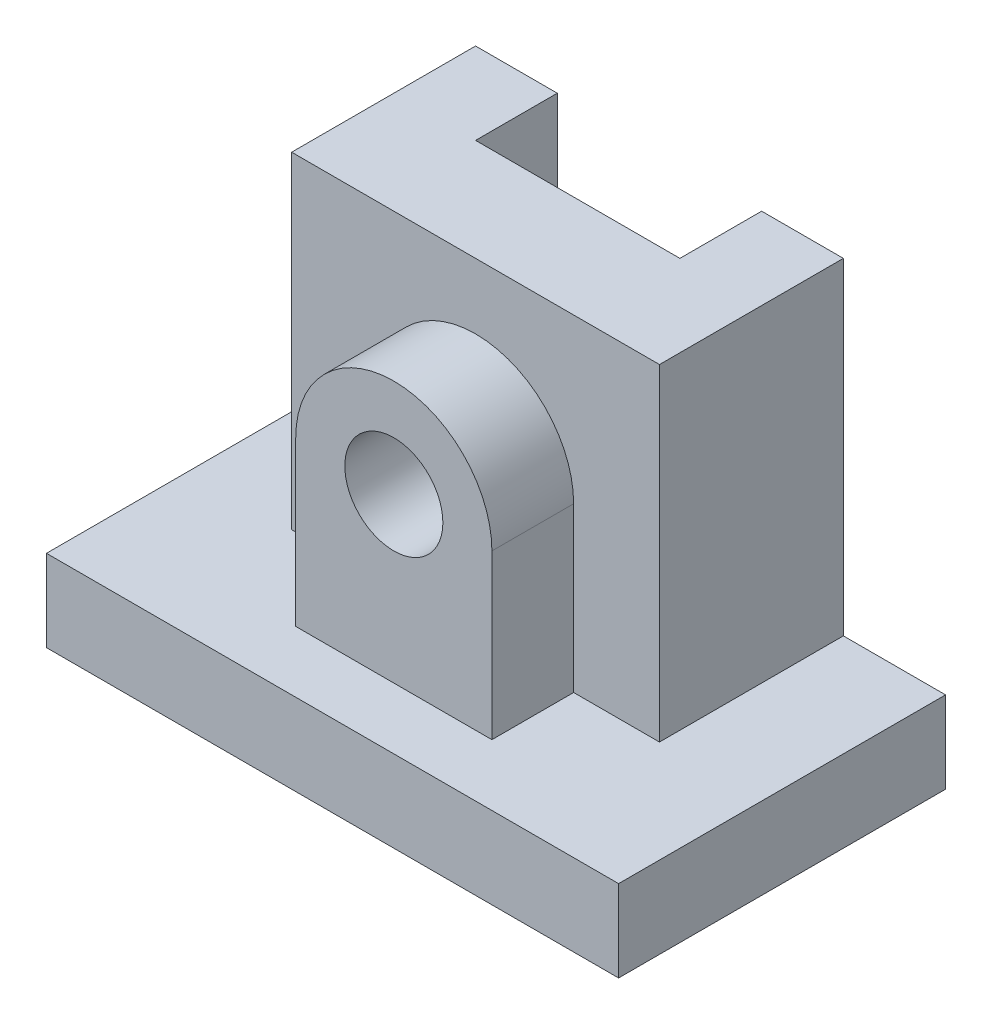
ISO-10303-21;
HEADER;
FILE_DESCRIPTION(('STEP AP214'),'2;1');
FILE_NAME('part.step','',(''),(''),'','','');
FILE_SCHEMA(('AUTOMOTIVE_DESIGN { 1 0 10303 214 1 1 1 1 }'));
ENDSEC;
DATA;
#1=APPLICATION_CONTEXT('core data for automotive mechanical design processes');
#2=APPLICATION_PROTOCOL_DEFINITION('international standard','automotive_design',2000,#1);
#3=PRODUCT_CONTEXT('',#1,'mechanical');
#4=PRODUCT('Part','Part','',(#3));
#5=PRODUCT_RELATED_PRODUCT_CATEGORY('part','',(#4));
#6=PRODUCT_DEFINITION_FORMATION('','',#4);
#7=PRODUCT_DEFINITION_CONTEXT('part definition',#1,'design');
#8=PRODUCT_DEFINITION('design','',#6,#7);
#9=PRODUCT_DEFINITION_SHAPE('','',#8);
#10=(LENGTH_UNIT() NAMED_UNIT(*) SI_UNIT(.MILLI.,.METRE.));
#11=(NAMED_UNIT(*) PLANE_ANGLE_UNIT() SI_UNIT($,.RADIAN.));
#12=(NAMED_UNIT(*) SI_UNIT($,.STERADIAN.) SOLID_ANGLE_UNIT());
#13=UNCERTAINTY_MEASURE_WITH_UNIT(LENGTH_MEASURE(1.E-05),#10,'distance_accuracy_value','');
#14=(GEOMETRIC_REPRESENTATION_CONTEXT(3) GLOBAL_UNCERTAINTY_ASSIGNED_CONTEXT((#13)) GLOBAL_UNIT_ASSIGNED_CONTEXT((#10,
#11,#12)) REPRESENTATION_CONTEXT('',''));
#15=CARTESIAN_POINT('',(0.,0.,0.));
#16=DIRECTION('',(0.,0.,1.));
#17=DIRECTION('',(1.,0.,0.));
#18=AXIS2_PLACEMENT_3D('',#15,#16,#17);
#19=CARTESIAN_POINT('',(-70.,20.,0.));
#20=DIRECTION('',(0.,0.,1.));
#21=DIRECTION('',(1.,0.,0.));
#22=AXIS2_PLACEMENT_3D('',#19,#20,#21);
#23=PLANE('',#22);
#24=DIRECTION('',(-1.,0.,0.));
#25=VECTOR('',#24,1.);
#26=CARTESIAN_POINT('',(-45.,100.,0.));
#27=LINE('',#26,#25);
#28=CARTESIAN_POINT('',(-25.,100.,0.));
#29=VERTEX_POINT('',#28);
#30=CARTESIAN_POINT('',(-45.,100.,0.));
#31=VERTEX_POINT('',#30);
#32=EDGE_CURVE('E222',#29,#31,#27,.T.);
#33=ORIENTED_EDGE('',*,*,#32,.F.);
#34=DIRECTION('',(0.,1.,0.));
#35=VECTOR('',#34,1.);
#36=CARTESIAN_POINT('',(-25.,0.,0.));
#37=LINE('',#36,#35);
#38=CARTESIAN_POINT('',(-25.,0.,0.));
#39=VERTEX_POINT('',#38);
#40=EDGE_CURVE('E176',#39,#29,#37,.T.);
#41=ORIENTED_EDGE('',*,*,#40,.F.);
#42=DIRECTION('',(-1.,0.,0.));
#43=VECTOR('',#42,1.);
#44=CARTESIAN_POINT('',(-70.,0.,0.));
#45=LINE('',#44,#43);
#46=CARTESIAN_POINT('',(-70.,0.,0.));
#47=VERTEX_POINT('',#46);
#48=EDGE_CURVE('E167',#39,#47,#45,.T.);
#49=ORIENTED_EDGE('',*,*,#48,.T.);
#50=DIRECTION('',(0.,-1.,0.));
#51=VECTOR('',#50,1.);
#52=CARTESIAN_POINT('',(-70.,20.,0.));
#53=LINE('',#52,#51);
#54=CARTESIAN_POINT('',(-70.,20.,0.));
#55=VERTEX_POINT('',#54);
#56=EDGE_CURVE('E279',#55,#47,#53,.T.);
#57=ORIENTED_EDGE('',*,*,#56,.F.);
#58=DIRECTION('',(-1.,0.,0.));
#59=VECTOR('',#58,1.);
#60=CARTESIAN_POINT('',(-70.,20.,0.));
#61=LINE('',#60,#59);
#62=CARTESIAN_POINT('',(-45.,20.,0.));
#63=VERTEX_POINT('',#62);
#64=EDGE_CURVE('E258',#63,#55,#61,.T.);
#65=ORIENTED_EDGE('',*,*,#64,.F.);
#66=DIRECTION('',(0.,-1.,0.));
#67=VECTOR('',#66,1.);
#68=CARTESIAN_POINT('',(-45.,100.,0.));
#69=LINE('',#68,#67);
#70=EDGE_CURVE('E226',#31,#63,#69,.T.);
#71=ORIENTED_EDGE('',*,*,#70,.F.);
#72=EDGE_LOOP('',(#33,#41,#49,#57,#65,#71));
#73=FACE_BOUND('',#72,.T.);
#74=ADVANCED_FACE('F31',(#73),#23,.F.);
#75=CARTESIAN_POINT('',(-70.,20.,0.));
#76=DIRECTION('',(0.,1.,0.));
#77=DIRECTION('',(0.,0.,1.));
#78=AXIS2_PLACEMENT_3D('',#75,#76,#77);
#79=PLANE('',#78);
#80=DIRECTION('',(1.,0.,0.));
#81=VECTOR('',#80,1.);
#82=CARTESIAN_POINT('',(-45.,20.,45.));
#83=LINE('',#82,#81);
#84=CARTESIAN_POINT('',(24.,20.,45.));
#85=VERTEX_POINT('',#84);
#86=CARTESIAN_POINT('',(45.,20.,45.));
#87=VERTEX_POINT('',#86);
#88=EDGE_CURVE('E229',#85,#87,#83,.T.);
#89=ORIENTED_EDGE('',*,*,#88,.F.);
#90=DIRECTION('',(0.,0.,-1.));
#91=VECTOR('',#90,1.);
#92=CARTESIAN_POINT('',(24.,20.,65.));
#93=LINE('',#92,#91);
#94=CARTESIAN_POINT('',(24.,20.,65.));
#95=VERTEX_POINT('',#94);
#96=EDGE_CURVE('E195',#95,#85,#93,.T.);
#97=ORIENTED_EDGE('',*,*,#96,.F.);
#98=DIRECTION('',(1.,0.,0.));
#99=VECTOR('',#98,1.);
#100=CARTESIAN_POINT('',(24.,20.,65.));
#101=LINE('',#100,#99);
#102=CARTESIAN_POINT('',(-24.,20.,65.));
#103=VERTEX_POINT('',#102);
#104=EDGE_CURVE('E56',#103,#95,#101,.T.);
#105=ORIENTED_EDGE('',*,*,#104,.F.);
#106=DIRECTION('',(0.,0.,-1.));
#107=VECTOR('',#106,1.);
#108=CARTESIAN_POINT('',(-24.,20.,65.));
#109=LINE('',#108,#107);
#110=CARTESIAN_POINT('',(-24.,20.,45.));
#111=VERTEX_POINT('',#110);
#112=EDGE_CURVE('E205',#103,#111,#109,.T.);
#113=ORIENTED_EDGE('',*,*,#112,.T.);
#114=CARTESIAN_POINT('',(-45.,20.,45.));
#115=VERTEX_POINT('',#114);
#116=EDGE_CURVE('E227',#115,#111,#83,.T.);
#117=ORIENTED_EDGE('',*,*,#116,.F.);
#118=DIRECTION('',(0.,0.,1.));
#119=VECTOR('',#118,1.);
#120=CARTESIAN_POINT('',(-45.,20.,0.));
#121=LINE('',#120,#119);
#122=EDGE_CURVE('E213',#63,#115,#121,.T.);
#123=ORIENTED_EDGE('',*,*,#122,.F.);
#124=ORIENTED_EDGE('',*,*,#64,.T.);
#125=DIRECTION('',(0.,0.,1.));
#126=VECTOR('',#125,1.);
#127=CARTESIAN_POINT('',(-70.,20.,0.));
#128=LINE('',#127,#126);
#129=CARTESIAN_POINT('',(-70.,20.,80.));
#130=VERTEX_POINT('',#129);
#131=EDGE_CURVE('E278',#55,#130,#128,.T.);
#132=ORIENTED_EDGE('',*,*,#131,.T.);
#133=DIRECTION('',(1.,0.,0.));
#134=VECTOR('',#133,1.);
#135=CARTESIAN_POINT('',(-70.,20.,80.));
#136=LINE('',#135,#134);
#137=CARTESIAN_POINT('',(70.,20.,80.));
#138=VERTEX_POINT('',#137);
#139=EDGE_CURVE('E351',#130,#138,#136,.T.);
#140=ORIENTED_EDGE('',*,*,#139,.T.);
#141=DIRECTION('',(0.,0.,-1.));
#142=VECTOR('',#141,1.);
#143=CARTESIAN_POINT('',(70.,20.,0.));
#144=LINE('',#143,#142);
#145=CARTESIAN_POINT('',(70.,20.,0.));
#146=VERTEX_POINT('',#145);
#147=EDGE_CURVE('E262',#138,#146,#144,.T.);
#148=ORIENTED_EDGE('',*,*,#147,.T.);
#149=CARTESIAN_POINT('',(45.,20.,0.));
#150=VERTEX_POINT('',#149);
#151=EDGE_CURVE('E261',#146,#150,#61,.T.);
#152=ORIENTED_EDGE('',*,*,#151,.T.);
#153=DIRECTION('',(0.,0.,-1.));
#154=VECTOR('',#153,1.);
#155=CARTESIAN_POINT('',(45.,20.,0.));
#156=LINE('',#155,#154);
#157=EDGE_CURVE('E218',#87,#150,#156,.T.);
#158=ORIENTED_EDGE('',*,*,#157,.F.);
#159=EDGE_LOOP('',(#89,#97,#105,#113,#117,#123,#124,#132,#140,#148,#152,#158));
#160=FACE_BOUND('',#159,.T.);
#161=ADVANCED_FACE('F297',(#160),#79,.T.);
#162=CARTESIAN_POINT('',(-45.,100.,45.));
#163=DIRECTION('',(0.,0.,-1.));
#164=DIRECTION('',(-1.,0.,0.));
#165=AXIS2_PLACEMENT_3D('',#162,#163,#164);
#166=PLANE('',#165);
#167=DIRECTION('',(0.,1.,0.));
#168=VECTOR('',#167,1.);
#169=CARTESIAN_POINT('',(24.,60.,45.));
#170=LINE('',#169,#168);
#171=CARTESIAN_POINT('',(24.,60.,45.));
#172=VERTEX_POINT('',#171);
#173=EDGE_CURVE('E185',#85,#172,#170,.T.);
#174=ORIENTED_EDGE('',*,*,#173,.F.);
#175=ORIENTED_EDGE('',*,*,#88,.T.);
#176=DIRECTION('',(0.,-1.,0.));
#177=VECTOR('',#176,1.);
#178=CARTESIAN_POINT('',(45.,100.,45.));
#179=LINE('',#178,#177);
#180=CARTESIAN_POINT('',(45.,100.,45.));
#181=VERTEX_POINT('',#180);
#182=EDGE_CURVE('E232',#181,#87,#179,.T.);
#183=ORIENTED_EDGE('',*,*,#182,.F.);
#184=DIRECTION('',(1.,0.,0.));
#185=VECTOR('',#184,1.);
#186=CARTESIAN_POINT('',(-45.,100.,45.));
#187=LINE('',#186,#185);
#188=CARTESIAN_POINT('',(-45.,100.,45.));
#189=VERTEX_POINT('',#188);
#190=EDGE_CURVE('E217',#189,#181,#187,.T.);
#191=ORIENTED_EDGE('',*,*,#190,.F.);
#192=DIRECTION('',(0.,-1.,0.));
#193=VECTOR('',#192,1.);
#194=CARTESIAN_POINT('',(-45.,100.,45.));
#195=LINE('',#194,#193);
#196=EDGE_CURVE('E248',#189,#115,#195,.T.);
#197=ORIENTED_EDGE('',*,*,#196,.T.);
#198=ORIENTED_EDGE('',*,*,#116,.T.);
#199=DIRECTION('',(0.,-1.,0.));
#200=VECTOR('',#199,1.);
#201=CARTESIAN_POINT('',(-24.,20.,45.));
#202=LINE('',#201,#200);
#203=CARTESIAN_POINT('',(-24.,60.,45.));
#204=VERTEX_POINT('',#203);
#205=EDGE_CURVE('E190',#204,#111,#202,.T.);
#206=ORIENTED_EDGE('',*,*,#205,.F.);
#207=CARTESIAN_POINT('',(0.,60.,45.));
#208=DIRECTION('',(0.,0.,1.));
#209=DIRECTION('',(-1.,0.,0.));
#210=AXIS2_PLACEMENT_3D('',#207,#208,#209);
#211=CIRCLE('',#210,24.);
#212=EDGE_CURVE('E198',#172,#204,#211,.T.);
#213=ORIENTED_EDGE('',*,*,#212,.F.);
#214=EDGE_LOOP('',(#174,#175,#183,#191,#197,#198,#206,#213));
#215=FACE_BOUND('',#214,.T.);
#216=ADVANCED_FACE('F303',(#215),#166,.F.);
#217=CARTESIAN_POINT('',(-70.,20.,0.));
#218=DIRECTION('',(1.,0.,0.));
#219=DIRECTION('',(0.,0.,-1.));
#220=AXIS2_PLACEMENT_3D('',#217,#218,#219);
#221=PLANE('',#220);
#222=DIRECTION('',(0.,0.,1.));
#223=VECTOR('',#222,1.);
#224=CARTESIAN_POINT('',(-70.,0.,0.));
#225=LINE('',#224,#223);
#226=CARTESIAN_POINT('',(-70.,0.,80.));
#227=VERTEX_POINT('',#226);
#228=EDGE_CURVE('E267',#47,#227,#225,.T.);
#229=ORIENTED_EDGE('',*,*,#228,.T.);
#230=DIRECTION('',(0.,-1.,0.));
#231=VECTOR('',#230,1.);
#232=CARTESIAN_POINT('',(-70.,20.,80.));
#233=LINE('',#232,#231);
#234=EDGE_CURVE('E11',#130,#227,#233,.T.);
#235=ORIENTED_EDGE('',*,*,#234,.F.);
#236=ORIENTED_EDGE('',*,*,#131,.F.);
#237=ORIENTED_EDGE('',*,*,#56,.T.);
#238=EDGE_LOOP('',(#229,#235,#236,#237));
#239=FACE_BOUND('',#238,.T.);
#240=ADVANCED_FACE('F33',(#239),#221,.F.);
#241=CARTESIAN_POINT('',(-70.,20.,80.));
#242=DIRECTION('',(0.,0.,-1.));
#243=DIRECTION('',(-1.,0.,0.));
#244=AXIS2_PLACEMENT_3D('',#241,#242,#243);
#245=PLANE('',#244);
#246=DIRECTION('',(1.,0.,0.));
#247=VECTOR('',#246,1.);
#248=CARTESIAN_POINT('',(-70.,0.,80.));
#249=LINE('',#248,#247);
#250=CARTESIAN_POINT('',(70.,0.,80.));
#251=VERTEX_POINT('',#250);
#252=EDGE_CURVE('E271',#227,#251,#249,.T.);
#253=ORIENTED_EDGE('',*,*,#252,.T.);
#254=DIRECTION('',(0.,-1.,0.));
#255=VECTOR('',#254,1.);
#256=CARTESIAN_POINT('',(70.,20.,80.));
#257=LINE('',#256,#255);
#258=EDGE_CURVE('E40',#138,#251,#257,.T.);
#259=ORIENTED_EDGE('',*,*,#258,.F.);
#260=ORIENTED_EDGE('',*,*,#139,.F.);
#261=ORIENTED_EDGE('',*,*,#234,.T.);
#262=EDGE_LOOP('',(#253,#259,#260,#261));
#263=FACE_BOUND('',#262,.T.);
#264=ADVANCED_FACE('F342',(#263),#245,.F.);
#265=CARTESIAN_POINT('',(70.,20.,0.));
#266=DIRECTION('',(-1.,0.,0.));
#267=DIRECTION('',(0.,0.,1.));
#268=AXIS2_PLACEMENT_3D('',#265,#266,#267);
#269=PLANE('',#268);
#270=DIRECTION('',(0.,0.,-1.));
#271=VECTOR('',#270,1.);
#272=CARTESIAN_POINT('',(70.,0.,0.));
#273=LINE('',#272,#271);
#274=CARTESIAN_POINT('',(70.,0.,0.));
#275=VERTEX_POINT('',#274);
#276=EDGE_CURVE('E273',#251,#275,#273,.T.);
#277=ORIENTED_EDGE('',*,*,#276,.T.);
#278=DIRECTION('',(0.,-1.,0.));
#279=VECTOR('',#278,1.);
#280=CARTESIAN_POINT('',(70.,20.,0.));
#281=LINE('',#280,#279);
#282=EDGE_CURVE('E282',#146,#275,#281,.T.);
#283=ORIENTED_EDGE('',*,*,#282,.F.);
#284=ORIENTED_EDGE('',*,*,#147,.F.);
#285=ORIENTED_EDGE('',*,*,#258,.T.);
#286=EDGE_LOOP('',(#277,#283,#284,#285));
#287=FACE_BOUND('',#286,.T.);
#288=ADVANCED_FACE('F290',(#287),#269,.F.);
#289=CARTESIAN_POINT('',(25.,0.,0.));
#290=VERTEX_POINT('',#289);
#291=EDGE_CURVE('E275',#275,#290,#45,.T.);
#292=ORIENTED_EDGE('',*,*,#291,.T.);
#293=DIRECTION('',(0.,1.,0.));
#294=VECTOR('',#293,1.);
#295=CARTESIAN_POINT('',(25.,0.,0.));
#296=LINE('',#295,#294);
#297=CARTESIAN_POINT('',(25.,100.,0.));
#298=VERTEX_POINT('',#297);
#299=EDGE_CURVE('E178',#290,#298,#296,.T.);
#300=ORIENTED_EDGE('',*,*,#299,.T.);
#301=CARTESIAN_POINT('',(45.,100.,0.));
#302=VERTEX_POINT('',#301);
#303=EDGE_CURVE('E223',#302,#298,#27,.T.);
#304=ORIENTED_EDGE('',*,*,#303,.F.);
#305=DIRECTION('',(0.,-1.,0.));
#306=VECTOR('',#305,1.);
#307=CARTESIAN_POINT('',(45.,100.,0.));
#308=LINE('',#307,#306);
#309=EDGE_CURVE('E240',#302,#150,#308,.T.);
#310=ORIENTED_EDGE('',*,*,#309,.T.);
#311=ORIENTED_EDGE('',*,*,#151,.F.);
#312=ORIENTED_EDGE('',*,*,#282,.T.);
#313=EDGE_LOOP('',(#292,#300,#304,#310,#311,#312));
#314=FACE_BOUND('',#313,.T.);
#315=ADVANCED_FACE('F294',(#314),#23,.F.);
#316=CARTESIAN_POINT('',(-70.,0.,0.));
#317=DIRECTION('',(0.,1.,0.));
#318=DIRECTION('',(0.,0.,1.));
#319=AXIS2_PLACEMENT_3D('',#316,#317,#318);
#320=PLANE('',#319);
#321=ORIENTED_EDGE('',*,*,#48,.F.);
#322=DIRECTION('',(0.,0.,1.));
#323=VECTOR('',#322,1.);
#324=CARTESIAN_POINT('',(-25.,0.,0.));
#325=LINE('',#324,#323);
#326=CARTESIAN_POINT('',(-25.,0.,20.));
#327=VERTEX_POINT('',#326);
#328=EDGE_CURVE('E148',#39,#327,#325,.T.);
#329=ORIENTED_EDGE('',*,*,#328,.T.);
#330=DIRECTION('',(1.,0.,0.));
#331=VECTOR('',#330,1.);
#332=CARTESIAN_POINT('',(-25.,0.,20.));
#333=LINE('',#332,#331);
#334=CARTESIAN_POINT('',(25.,0.,20.));
#335=VERTEX_POINT('',#334);
#336=EDGE_CURVE('E157',#327,#335,#333,.T.);
#337=ORIENTED_EDGE('',*,*,#336,.T.);
#338=DIRECTION('',(0.,0.,-1.));
#339=VECTOR('',#338,1.);
#340=CARTESIAN_POINT('',(25.,0.,0.));
#341=LINE('',#340,#339);
#342=EDGE_CURVE('E154',#335,#290,#341,.T.);
#343=ORIENTED_EDGE('',*,*,#342,.T.);
#344=ORIENTED_EDGE('',*,*,#291,.F.);
#345=ORIENTED_EDGE('',*,*,#276,.F.);
#346=ORIENTED_EDGE('',*,*,#252,.F.);
#347=ORIENTED_EDGE('',*,*,#228,.F.);
#348=EDGE_LOOP('',(#321,#329,#337,#343,#344,#345,#346,#347));
#349=FACE_BOUND('',#348,.T.);
#350=ADVANCED_FACE('F165',(#349),#320,.F.);
#351=CARTESIAN_POINT('',(-45.,100.,0.));
#352=DIRECTION('',(1.,0.,0.));
#353=DIRECTION('',(0.,0.,-1.));
#354=AXIS2_PLACEMENT_3D('',#351,#352,#353);
#355=PLANE('',#354);
#356=ORIENTED_EDGE('',*,*,#122,.T.);
#357=ORIENTED_EDGE('',*,*,#196,.F.);
#358=DIRECTION('',(0.,0.,1.));
#359=VECTOR('',#358,1.);
#360=CARTESIAN_POINT('',(-45.,100.,0.));
#361=LINE('',#360,#359);
#362=EDGE_CURVE('E214',#31,#189,#361,.T.);
#363=ORIENTED_EDGE('',*,*,#362,.F.);
#364=ORIENTED_EDGE('',*,*,#70,.T.);
#365=EDGE_LOOP('',(#356,#357,#363,#364));
#366=FACE_BOUND('',#365,.T.);
#367=ADVANCED_FACE('F318',(#366),#355,.F.);
#368=CARTESIAN_POINT('',(45.,100.,0.));
#369=DIRECTION('',(-1.,0.,0.));
#370=DIRECTION('',(0.,0.,1.));
#371=AXIS2_PLACEMENT_3D('',#368,#369,#370);
#372=PLANE('',#371);
#373=ORIENTED_EDGE('',*,*,#157,.T.);
#374=ORIENTED_EDGE('',*,*,#309,.F.);
#375=DIRECTION('',(0.,0.,-1.));
#376=VECTOR('',#375,1.);
#377=CARTESIAN_POINT('',(45.,100.,0.));
#378=LINE('',#377,#376);
#379=EDGE_CURVE('E220',#181,#302,#378,.T.);
#380=ORIENTED_EDGE('',*,*,#379,.F.);
#381=ORIENTED_EDGE('',*,*,#182,.T.);
#382=EDGE_LOOP('',(#373,#374,#380,#381));
#383=FACE_BOUND('',#382,.T.);
#384=ADVANCED_FACE('F299',(#383),#372,.F.);
#385=CARTESIAN_POINT('',(-45.,100.,45.));
#386=DIRECTION('',(0.,1.,0.));
#387=DIRECTION('',(0.,0.,1.));
#388=AXIS2_PLACEMENT_3D('',#385,#386,#387);
#389=PLANE('',#388);
#390=DIRECTION('',(0.,0.,1.));
#391=VECTOR('',#390,1.);
#392=CARTESIAN_POINT('',(-25.,100.,0.));
#393=LINE('',#392,#391);
#394=CARTESIAN_POINT('',(-25.,100.,20.));
#395=VERTEX_POINT('',#394);
#396=EDGE_CURVE('E48',#29,#395,#393,.T.);
#397=ORIENTED_EDGE('',*,*,#396,.F.);
#398=ORIENTED_EDGE('',*,*,#32,.T.);
#399=ORIENTED_EDGE('',*,*,#362,.T.);
#400=ORIENTED_EDGE('',*,*,#190,.T.);
#401=ORIENTED_EDGE('',*,*,#379,.T.);
#402=ORIENTED_EDGE('',*,*,#303,.T.);
#403=DIRECTION('',(0.,0.,-1.));
#404=VECTOR('',#403,1.);
#405=CARTESIAN_POINT('',(25.,100.,0.));
#406=LINE('',#405,#404);
#407=CARTESIAN_POINT('',(25.,100.,20.));
#408=VERTEX_POINT('',#407);
#409=EDGE_CURVE('E168',#408,#298,#406,.T.);
#410=ORIENTED_EDGE('',*,*,#409,.F.);
#411=DIRECTION('',(1.,0.,0.));
#412=VECTOR('',#411,1.);
#413=CARTESIAN_POINT('',(-25.,100.,20.));
#414=LINE('',#413,#412);
#415=EDGE_CURVE('E170',#395,#408,#414,.T.);
#416=ORIENTED_EDGE('',*,*,#415,.F.);
#417=EDGE_LOOP('',(#397,#398,#399,#400,#401,#402,#410,#416));
#418=FACE_BOUND('',#417,.T.);
#419=ADVANCED_FACE('F325',(#418),#389,.T.);
#420=CARTESIAN_POINT('',(24.,60.,65.));
#421=DIRECTION('',(-1.,0.,0.));
#422=DIRECTION('',(0.,0.,1.));
#423=AXIS2_PLACEMENT_3D('',#420,#421,#422);
#424=PLANE('',#423);
#425=ORIENTED_EDGE('',*,*,#173,.T.);
#426=DIRECTION('',(0.,0.,-1.));
#427=VECTOR('',#426,1.);
#428=CARTESIAN_POINT('',(24.,60.,65.));
#429=LINE('',#428,#427);
#430=CARTESIAN_POINT('',(24.,60.,65.));
#431=VERTEX_POINT('',#430);
#432=EDGE_CURVE('E210',#431,#172,#429,.T.);
#433=ORIENTED_EDGE('',*,*,#432,.F.);
#434=DIRECTION('',(0.,1.,0.));
#435=VECTOR('',#434,1.);
#436=CARTESIAN_POINT('',(24.,60.,65.));
#437=LINE('',#436,#435);
#438=EDGE_CURVE('E186',#95,#431,#437,.T.);
#439=ORIENTED_EDGE('',*,*,#438,.F.);
#440=ORIENTED_EDGE('',*,*,#96,.T.);
#441=EDGE_LOOP('',(#425,#433,#439,#440));
#442=FACE_BOUND('',#441,.T.);
#443=ADVANCED_FACE('F307',(#442),#424,.F.);
#444=CARTESIAN_POINT('',(0.,60.,65.));
#445=DIRECTION('',(0.,0.,-1.));
#446=DIRECTION('',(-1.,0.,0.));
#447=AXIS2_PLACEMENT_3D('',#444,#445,#446);
#448=CYLINDRICAL_SURFACE('',#447,24.);
#449=ORIENTED_EDGE('',*,*,#212,.T.);
#450=DIRECTION('',(0.,0.,-1.));
#451=VECTOR('',#450,1.);
#452=CARTESIAN_POINT('',(-24.,60.,65.));
#453=LINE('',#452,#451);
#454=CARTESIAN_POINT('',(-24.,60.,65.));
#455=VERTEX_POINT('',#454);
#456=EDGE_CURVE('E207',#455,#204,#453,.T.);
#457=ORIENTED_EDGE('',*,*,#456,.F.);
#458=CARTESIAN_POINT('',(0.,60.,65.));
#459=DIRECTION('',(0.,0.,1.));
#460=DIRECTION('',(-1.,0.,0.));
#461=AXIS2_PLACEMENT_3D('',#458,#459,#460);
#462=CIRCLE('',#461,24.);
#463=EDGE_CURVE('E189',#431,#455,#462,.T.);
#464=ORIENTED_EDGE('',*,*,#463,.F.);
#465=ORIENTED_EDGE('',*,*,#432,.T.);
#466=EDGE_LOOP('',(#449,#457,#464,#465));
#467=FACE_BOUND('',#466,.T.);
#468=ADVANCED_FACE('F377',(#467),#448,.T.);
#469=CARTESIAN_POINT('',(-24.,20.,65.));
#470=DIRECTION('',(1.,0.,0.));
#471=DIRECTION('',(0.,0.,-1.));
#472=AXIS2_PLACEMENT_3D('',#469,#470,#471);
#473=PLANE('',#472);
#474=ORIENTED_EDGE('',*,*,#205,.T.);
#475=ORIENTED_EDGE('',*,*,#112,.F.);
#476=DIRECTION('',(0.,-1.,0.));
#477=VECTOR('',#476,1.);
#478=CARTESIAN_POINT('',(-24.,20.,65.));
#479=LINE('',#478,#477);
#480=EDGE_CURVE('E192',#455,#103,#479,.T.);
#481=ORIENTED_EDGE('',*,*,#480,.F.);
#482=ORIENTED_EDGE('',*,*,#456,.T.);
#483=EDGE_LOOP('',(#474,#475,#481,#482));
#484=FACE_BOUND('',#483,.T.);
#485=ADVANCED_FACE('F315',(#484),#473,.F.);
#486=CARTESIAN_POINT('',(0.,60.,65.));
#487=DIRECTION('',(0.,0.,-1.));
#488=DIRECTION('',(-1.,0.,0.));
#489=AXIS2_PLACEMENT_3D('',#486,#487,#488);
#490=PLANE('',#489);
#491=CARTESIAN_POINT('',(0.,60.,65.));
#492=DIRECTION('',(0.,0.,1.));
#493=DIRECTION('',(1.,0.,0.));
#494=AXIS2_PLACEMENT_3D('',#491,#492,#493);
#495=CIRCLE('',#494,12.);
#496=CARTESIAN_POINT('',(12.,60.,65.));
#497=VERTEX_POINT('',#496);
#498=EDGE_CURVE('E182',#497,#497,#495,.T.);
#499=ORIENTED_EDGE('',*,*,#498,.F.);
#500=EDGE_LOOP('',(#499));
#501=FACE_BOUND('',#500,.T.);
#502=ORIENTED_EDGE('',*,*,#438,.T.);
#503=ORIENTED_EDGE('',*,*,#463,.T.);
#504=ORIENTED_EDGE('',*,*,#480,.T.);
#505=ORIENTED_EDGE('',*,*,#104,.T.);
#506=EDGE_LOOP('',(#502,#503,#504,#505));
#507=FACE_BOUND('',#506,.T.);
#508=ADVANCED_FACE('F310',(#501,#507),#490,.F.);
#509=CARTESIAN_POINT('',(0.,60.,-5.00000000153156E-05));
#510=DIRECTION('',(0.,0.,1.));
#511=DIRECTION('',(1.,0.,0.));
#512=AXIS2_PLACEMENT_3D('',#509,#510,#511);
#513=CYLINDRICAL_SURFACE('',#512,12.);
#514=CARTESIAN_POINT('',(0.,60.,20.));
#515=DIRECTION('',(0.,0.,1.));
#516=DIRECTION('',(1.,0.,0.));
#517=AXIS2_PLACEMENT_3D('',#514,#515,#516);
#518=CIRCLE('',#517,12.);
#519=CARTESIAN_POINT('',(12.,60.,20.));
#520=VERTEX_POINT('',#519);
#521=EDGE_CURVE('E35',#520,#520,#518,.F.);
#522=ORIENTED_EDGE('',*,*,#521,.T.);
#523=EDGE_LOOP('',(#522));
#524=FACE_BOUND('',#523,.T.);
#525=ORIENTED_EDGE('',*,*,#498,.T.);
#526=EDGE_LOOP('',(#525));
#527=FACE_BOUND('',#526,.T.);
#528=ADVANCED_FACE('F367',(#524,#527),#513,.F.);
#529=CARTESIAN_POINT('',(-25.,0.,20.));
#530=DIRECTION('',(0.,0.,1.));
#531=DIRECTION('',(1.,0.,0.));
#532=AXIS2_PLACEMENT_3D('',#529,#530,#531);
#533=PLANE('',#532);
#534=ORIENTED_EDGE('',*,*,#415,.T.);
#535=DIRECTION('',(0.,1.,0.));
#536=VECTOR('',#535,1.);
#537=CARTESIAN_POINT('',(25.,0.,20.));
#538=LINE('',#537,#536);
#539=EDGE_CURVE('E153',#335,#408,#538,.T.);
#540=ORIENTED_EDGE('',*,*,#539,.F.);
#541=ORIENTED_EDGE('',*,*,#336,.F.);
#542=DIRECTION('',(0.,1.,0.));
#543=VECTOR('',#542,1.);
#544=CARTESIAN_POINT('',(-25.,0.,20.));
#545=LINE('',#544,#543);
#546=EDGE_CURVE('E144',#327,#395,#545,.T.);
#547=ORIENTED_EDGE('',*,*,#546,.T.);
#548=EDGE_LOOP('',(#534,#540,#541,#547));
#549=FACE_BOUND('',#548,.T.);
#550=ORIENTED_EDGE('',*,*,#521,.F.);
#551=EDGE_LOOP('',(#550));
#552=FACE_BOUND('',#551,.T.);
#553=ADVANCED_FACE('F158',(#549,#552),#533,.F.);
#554=CARTESIAN_POINT('',(-25.,0.,0.));
#555=DIRECTION('',(-1.,0.,0.));
#556=DIRECTION('',(0.,0.,1.));
#557=AXIS2_PLACEMENT_3D('',#554,#555,#556);
#558=PLANE('',#557);
#559=ORIENTED_EDGE('',*,*,#396,.T.);
#560=ORIENTED_EDGE('',*,*,#546,.F.);
#561=ORIENTED_EDGE('',*,*,#328,.F.);
#562=ORIENTED_EDGE('',*,*,#40,.T.);
#563=EDGE_LOOP('',(#559,#560,#561,#562));
#564=FACE_BOUND('',#563,.T.);
#565=ADVANCED_FACE('F146',(#564),#558,.F.);
#566=CARTESIAN_POINT('',(25.,0.,0.));
#567=DIRECTION('',(1.,0.,0.));
#568=DIRECTION('',(0.,0.,-1.));
#569=AXIS2_PLACEMENT_3D('',#566,#567,#568);
#570=PLANE('',#569);
#571=ORIENTED_EDGE('',*,*,#409,.T.);
#572=ORIENTED_EDGE('',*,*,#299,.F.);
#573=ORIENTED_EDGE('',*,*,#342,.F.);
#574=ORIENTED_EDGE('',*,*,#539,.T.);
#575=EDGE_LOOP('',(#571,#572,#573,#574));
#576=FACE_BOUND('',#575,.T.);
#577=ADVANCED_FACE('F358',(#576),#570,.F.);
#578=CLOSED_SHELL('',(#74,#161,#216,#240,#264,#288,#315,#350,#367,#384,#419,#443,#468,#485,#508,
#528,#553,#565,#577));
#579=MANIFOLD_SOLID_BREP('B2',#578);
#580=ADVANCED_BREP_SHAPE_REPRESENTATION('',(#18,#579),#14);
#581=SHAPE_DEFINITION_REPRESENTATION(#9,#580);
ENDSEC;
END-ISO-10303-21;
